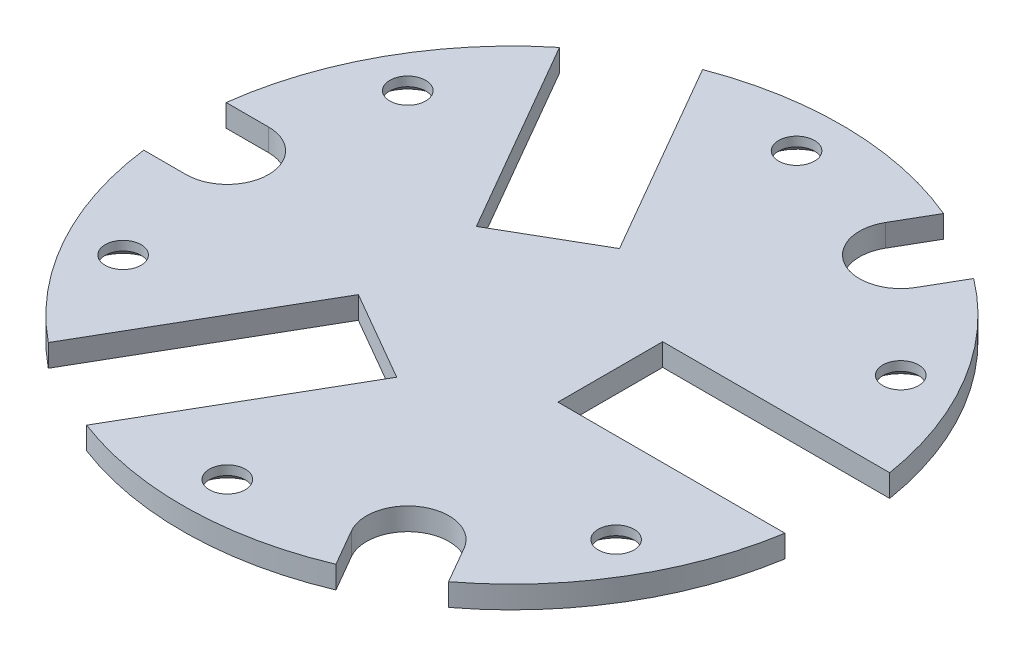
ISO-10303-21;
HEADER;
FILE_DESCRIPTION(('STEP AP214'),'2;1');
FILE_NAME('part.step','',(''),(''),'','','');
FILE_SCHEMA(('AUTOMOTIVE_DESIGN { 1 0 10303 214 1 1 1 1 }'));
ENDSEC;
DATA;
#1=APPLICATION_CONTEXT('core data for automotive mechanical design processes');
#2=APPLICATION_PROTOCOL_DEFINITION('international standard','automotive_design',2000,#1);
#3=PRODUCT_CONTEXT('',#1,'mechanical');
#4=PRODUCT('Part','Part','',(#3));
#5=PRODUCT_RELATED_PRODUCT_CATEGORY('part','',(#4));
#6=PRODUCT_DEFINITION_FORMATION('','',#4);
#7=PRODUCT_DEFINITION_CONTEXT('part definition',#1,'design');
#8=PRODUCT_DEFINITION('design','',#6,#7);
#9=PRODUCT_DEFINITION_SHAPE('','',#8);
#10=(LENGTH_UNIT() NAMED_UNIT(*) SI_UNIT(.MILLI.,.METRE.));
#11=(NAMED_UNIT(*) PLANE_ANGLE_UNIT() SI_UNIT($,.RADIAN.));
#12=(NAMED_UNIT(*) SI_UNIT($,.STERADIAN.) SOLID_ANGLE_UNIT());
#13=UNCERTAINTY_MEASURE_WITH_UNIT(LENGTH_MEASURE(1.E-05),#10,'distance_accuracy_value','');
#14=(GEOMETRIC_REPRESENTATION_CONTEXT(3) GLOBAL_UNCERTAINTY_ASSIGNED_CONTEXT((#13)) GLOBAL_UNIT_ASSIGNED_CONTEXT((#10,
#11,#12)) REPRESENTATION_CONTEXT('',''));
#15=CARTESIAN_POINT('',(0.,0.,0.));
#16=DIRECTION('',(0.,0.,1.));
#17=DIRECTION('',(1.,0.,0.));
#18=AXIS2_PLACEMENT_3D('',#15,#16,#17);
#19=CARTESIAN_POINT('',(0.,-1.1811,0.));
#20=DIRECTION('',(0.,1.,0.));
#21=DIRECTION('',(0.,0.,1.));
#22=AXIS2_PLACEMENT_3D('',#19,#20,#21);
#23=PLANE('',#22);
#24=CARTESIAN_POINT('',(0.,-1.1811,30.1625));
#25=DIRECTION('',(0.,-1.,0.));
#26=DIRECTION('',(0.,0.,-1.));
#27=AXIS2_PLACEMENT_3D('',#24,#25,#26);
#28=CIRCLE('',#27,3.5433);
#29=CARTESIAN_POINT('',(0.,-1.1811,26.6192));
#30=VERTEX_POINT('',#29);
#31=EDGE_CURVE('E767',#30,#30,#28,.T.);
#32=ORIENTED_EDGE('',*,*,#31,.F.);
#33=EDGE_LOOP('',(#32));
#34=FACE_BOUND('',#33,.T.);
#35=CARTESIAN_POINT('',(-26.1214859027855,-1.1811,15.0812500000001));
#36=DIRECTION('',(0.,-1.,0.));
#37=DIRECTION('',(0.,0.,-1.));
#38=AXIS2_PLACEMENT_3D('',#35,#36,#37);
#39=CIRCLE('',#38,3.5433);
#40=CARTESIAN_POINT('',(-26.1214859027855,-1.1811,11.5379500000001));
#41=VERTEX_POINT('',#40);
#42=EDGE_CURVE('E774',#41,#41,#39,.T.);
#43=ORIENTED_EDGE('',*,*,#42,.F.);
#44=EDGE_LOOP('',(#43));
#45=FACE_BOUND('',#44,.T.);
#46=CARTESIAN_POINT('',(-26.1214859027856,-1.1811,-15.0812499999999));
#47=DIRECTION('',(0.,-1.,0.));
#48=DIRECTION('',(0.,0.,-1.));
#49=AXIS2_PLACEMENT_3D('',#46,#47,#48);
#50=CIRCLE('',#49,3.5433);
#51=CARTESIAN_POINT('',(-26.1214859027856,-1.1811,-18.6245499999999));
#52=VERTEX_POINT('',#51);
#53=EDGE_CURVE('E783',#52,#52,#50,.T.);
#54=ORIENTED_EDGE('',*,*,#53,.F.);
#55=EDGE_LOOP('',(#54));
#56=FACE_BOUND('',#55,.T.);
#57=CARTESIAN_POINT('',(0.,-1.1811,-30.1625));
#58=DIRECTION('',(0.,-1.,0.));
#59=DIRECTION('',(0.,0.,-1.));
#60=AXIS2_PLACEMENT_3D('',#57,#58,#59);
#61=CIRCLE('',#60,3.5433);
#62=CARTESIAN_POINT('',(0.,-1.1811,-33.7058));
#63=VERTEX_POINT('',#62);
#64=EDGE_CURVE('E792',#63,#63,#61,.T.);
#65=ORIENTED_EDGE('',*,*,#64,.F.);
#66=EDGE_LOOP('',(#65));
#67=FACE_BOUND('',#66,.T.);
#68=CARTESIAN_POINT('',(26.1214859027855,-1.1811,-15.0812500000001));
#69=DIRECTION('',(0.,-1.,0.));
#70=DIRECTION('',(0.,0.,-1.));
#71=AXIS2_PLACEMENT_3D('',#68,#69,#70);
#72=CIRCLE('',#71,3.5433);
#73=CARTESIAN_POINT('',(26.1214859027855,-1.1811,-18.6245500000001));
#74=VERTEX_POINT('',#73);
#75=EDGE_CURVE('E801',#74,#74,#72,.T.);
#76=ORIENTED_EDGE('',*,*,#75,.F.);
#77=EDGE_LOOP('',(#76));
#78=FACE_BOUND('',#77,.T.);
#79=CARTESIAN_POINT('',(15.0812499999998,-1.1811,26.1214912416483));
#80=DIRECTION('',(0.,1.,0.));
#81=DIRECTION('',(0.,0.,1.));
#82=AXIS2_PLACEMENT_3D('',#79,#80,#81);
#83=CIRCLE('',#82,4.3688);
#84=CARTESIAN_POINT('',(11.2977582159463,-1.1811,28.3058912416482));
#85=VERTEX_POINT('',#84);
#86=CARTESIAN_POINT('',(18.8647417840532,-1.1811,23.9370912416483));
#87=VERTEX_POINT('',#86);
#88=EDGE_CURVE('E51',#85,#87,#83,.F.);
#89=ORIENTED_EDGE('',*,*,#88,.F.);
#90=DIRECTION('',(-0.499999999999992,0.,-0.866025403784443));
#91=VECTOR('',#90,1.);
#92=CARTESIAN_POINT('',(13.5418452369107,-1.1811,32.1927639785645));
#93=LINE('',#92,#91);
#94=CARTESIAN_POINT('',(13.5418452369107,-1.1811,32.1927639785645));
#95=VERTEX_POINT('',#94);
#96=EDGE_CURVE('E820',#95,#85,#93,.T.);
#97=ORIENTED_EDGE('',*,*,#96,.F.);
#98=CARTESIAN_POINT('',(0.,-1.1811,0.));
#99=DIRECTION('',(0.,1.,0.));
#100=DIRECTION('',(0.,0.,1.));
#101=AXIS2_PLACEMENT_3D('',#98,#99,#100);
#102=CIRCLE('',#101,34.925);
#103=CARTESIAN_POINT('',(-12.434253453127,-1.1811,32.6365587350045));
#104=VERTEX_POINT('',#103);
#105=EDGE_CURVE('E219',#104,#95,#102,.T.);
#106=ORIENTED_EDGE('',*,*,#105,.F.);
#107=DIRECTION('',(0.500000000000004,0.,-0.866025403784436));
#108=VECTOR('',#107,1.);
#109=CARTESIAN_POINT('',(-12.434253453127,-1.1811,32.6365587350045));
#110=LINE('',#109,#108);
#111=CARTESIAN_POINT('',(-0.406995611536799,-1.1811,11.8047370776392));
#112=VERTEX_POINT('',#111);
#113=EDGE_CURVE('E266',#104,#112,#110,.T.);
#114=ORIENTED_EDGE('',*,*,#113,.T.);
#115=DIRECTION('',(-0.866025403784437,0.,-0.500000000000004));
#116=VECTOR('',#115,1.);
#117=CARTESIAN_POINT('',(-0.406995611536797,-1.1811,11.8047370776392));
#118=LINE('',#117,#116);
#119=CARTESIAN_POINT('',(-10.0197043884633,-1.1811,6.25483707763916));
#120=VERTEX_POINT('',#119);
#121=EDGE_CURVE('E373',#112,#120,#118,.T.);
#122=ORIENTED_EDGE('',*,*,#121,.T.);
#123=DIRECTION('',(-0.500000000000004,0.,0.866025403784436));
#124=VECTOR('',#123,1.);
#125=CARTESIAN_POINT('',(-22.0469622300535,-1.1811,27.0866587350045));
#126=LINE('',#125,#124);
#127=CARTESIAN_POINT('',(-22.0469622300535,-1.1811,27.0866587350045));
#128=VERTEX_POINT('',#127);
#129=EDGE_CURVE('E283',#120,#128,#126,.T.);
#130=ORIENTED_EDGE('',*,*,#129,.T.);
#131=CARTESIAN_POINT('',(-34.6506740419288,-1.1811,4.36880000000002));
#132=VERTEX_POINT('',#131);
#133=EDGE_CURVE('E223',#132,#128,#102,.T.);
#134=ORIENTED_EDGE('',*,*,#133,.F.);
#135=DIRECTION('',(-1.,0.,0.));
#136=VECTOR('',#135,1.);
#137=CARTESIAN_POINT('',(-30.1625,-1.1811,4.36880000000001));
#138=LINE('',#137,#136);
#139=CARTESIAN_POINT('',(-30.1625,-1.1811,4.36880000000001));
#140=VERTEX_POINT('',#139);
#141=EDGE_CURVE('E337',#140,#132,#138,.T.);
#142=ORIENTED_EDGE('',*,*,#141,.F.);
#143=CARTESIAN_POINT('',(-30.1625,-1.1811,0.));
#144=DIRECTION('',(0.,1.,0.));
#145=DIRECTION('',(0.,0.,1.));
#146=AXIS2_PLACEMENT_3D('',#143,#144,#145);
#147=CIRCLE('',#146,4.3688);
#148=CARTESIAN_POINT('',(-30.1625,-1.1811,-4.36879999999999));
#149=VERTEX_POINT('',#148);
#150=EDGE_CURVE('E312',#149,#140,#147,.F.);
#151=ORIENTED_EDGE('',*,*,#150,.F.);
#152=DIRECTION('',(1.,0.,0.));
#153=VECTOR('',#152,1.);
#154=CARTESIAN_POINT('',(-34.6506740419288,-1.1811,-4.36879999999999));
#155=LINE('',#154,#153);
#156=CARTESIAN_POINT('',(-34.6506740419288,-1.1811,-4.36879999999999));
#157=VERTEX_POINT('',#156);
#158=EDGE_CURVE('E324',#157,#149,#155,.T.);
#159=ORIENTED_EDGE('',*,*,#158,.F.);
#160=CARTESIAN_POINT('',(-22.0469622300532,-1.1811,-27.0866587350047));
#161=VERTEX_POINT('',#160);
#162=EDGE_CURVE('E224',#161,#157,#102,.T.);
#163=ORIENTED_EDGE('',*,*,#162,.F.);
#164=DIRECTION('',(0.499999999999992,0.,0.866025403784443));
#165=VECTOR('',#164,1.);
#166=CARTESIAN_POINT('',(-22.0469622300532,-1.1811,-27.0866587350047));
#167=LINE('',#166,#165);
#168=CARTESIAN_POINT('',(-10.0197043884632,-1.1811,-6.2548370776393));
#169=VERTEX_POINT('',#168);
#170=EDGE_CURVE('E345',#161,#169,#167,.T.);
#171=ORIENTED_EDGE('',*,*,#170,.T.);
#172=DIRECTION('',(0.866025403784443,0.,-0.499999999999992));
#173=VECTOR('',#172,1.);
#174=CARTESIAN_POINT('',(-10.0197043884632,-1.1811,-6.2548370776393));
#175=LINE('',#174,#173);
#176=CARTESIAN_POINT('',(-0.406995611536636,-1.1811,-11.8047370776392));
#177=VERTEX_POINT('',#176);
#178=EDGE_CURVE('E348',#169,#177,#175,.T.);
#179=ORIENTED_EDGE('',*,*,#178,.T.);
#180=DIRECTION('',(-0.499999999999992,0.,-0.866025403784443));
#181=VECTOR('',#180,1.);
#182=CARTESIAN_POINT('',(-12.4342534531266,-1.1811,-32.6365587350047));
#183=LINE('',#182,#181);
#184=CARTESIAN_POINT('',(-12.4342534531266,-1.1811,-32.6365587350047));
#185=VERTEX_POINT('',#184);
#186=EDGE_CURVE('E352',#177,#185,#183,.T.);
#187=ORIENTED_EDGE('',*,*,#186,.T.);
#188=CARTESIAN_POINT('',(13.5418452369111,-1.1811,-32.1927639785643));
#189=VERTEX_POINT('',#188);
#190=EDGE_CURVE('E221',#189,#185,#102,.T.);
#191=ORIENTED_EDGE('',*,*,#190,.F.);
#192=DIRECTION('',(0.500000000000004,0.,-0.866025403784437));
#193=VECTOR('',#192,1.);
#194=CARTESIAN_POINT('',(11.2977582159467,-1.1811,-28.3058912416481));
#195=LINE('',#194,#193);
#196=CARTESIAN_POINT('',(11.2977582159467,-1.1811,-28.3058912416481));
#197=VERTEX_POINT('',#196);
#198=EDGE_CURVE('E309',#197,#189,#195,.T.);
#199=ORIENTED_EDGE('',*,*,#198,.F.);
#200=CARTESIAN_POINT('',(15.0812500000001,-1.1811,-26.1214912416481));
#201=DIRECTION('',(0.,1.,0.));
#202=DIRECTION('',(0.,0.,1.));
#203=AXIS2_PLACEMENT_3D('',#200,#201,#202);
#204=CIRCLE('',#203,4.3688);
#205=CARTESIAN_POINT('',(18.8647417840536,-1.1811,-23.9370912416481));
#206=VERTEX_POINT('',#205);
#207=EDGE_CURVE('E59',#206,#197,#204,.F.);
#208=ORIENTED_EDGE('',*,*,#207,.F.);
#209=DIRECTION('',(-0.500000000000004,0.,0.866025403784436));
#210=VECTOR('',#209,1.);
#211=CARTESIAN_POINT('',(21.108828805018,-1.1811,-27.8239639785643));
#212=LINE('',#211,#210);
#213=CARTESIAN_POINT('',(21.108828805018,-1.1811,-27.8239639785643));
#214=VERTEX_POINT('',#213);
#215=EDGE_CURVE('E400',#214,#206,#212,.T.);
#216=ORIENTED_EDGE('',*,*,#215,.F.);
#217=CARTESIAN_POINT('',(34.4812156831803,-1.1811,-5.54990000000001));
#218=VERTEX_POINT('',#217);
#219=EDGE_CURVE('E37',#218,#214,#102,.T.);
#220=ORIENTED_EDGE('',*,*,#219,.F.);
#221=DIRECTION('',(-1.,0.,0.));
#222=VECTOR('',#221,1.);
#223=CARTESIAN_POINT('',(34.4812156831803,-1.1811,-5.54990000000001));
#224=LINE('',#223,#222);
#225=CARTESIAN_POINT('',(10.4267,-1.1811,-5.5499));
#226=VERTEX_POINT('',#225);
#227=EDGE_CURVE('E284',#218,#226,#224,.T.);
#228=ORIENTED_EDGE('',*,*,#227,.T.);
#229=DIRECTION('',(0.,0.,1.));
#230=VECTOR('',#229,1.);
#231=CARTESIAN_POINT('',(10.4267,-1.1811,-5.5499));
#232=LINE('',#231,#230);
#233=CARTESIAN_POINT('',(10.4267,-1.1811,5.5499));
#234=VERTEX_POINT('',#233);
#235=EDGE_CURVE('E287',#226,#234,#232,.T.);
#236=ORIENTED_EDGE('',*,*,#235,.T.);
#237=DIRECTION('',(1.,0.,0.));
#238=VECTOR('',#237,1.);
#239=CARTESIAN_POINT('',(34.4812156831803,-1.1811,5.5499));
#240=LINE('',#239,#238);
#241=CARTESIAN_POINT('',(34.4812156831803,-1.1811,5.5499));
#242=VERTEX_POINT('',#241);
#243=EDGE_CURVE('E218',#234,#242,#240,.T.);
#244=ORIENTED_EDGE('',*,*,#243,.T.);
#245=CARTESIAN_POINT('',(21.1088288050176,-1.1811,27.8239639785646));
#246=VERTEX_POINT('',#245);
#247=EDGE_CURVE('E210',#246,#242,#102,.T.);
#248=ORIENTED_EDGE('',*,*,#247,.F.);
#249=DIRECTION('',(0.499999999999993,0.,0.866025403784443));
#250=VECTOR('',#249,1.);
#251=CARTESIAN_POINT('',(18.8647417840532,-1.1811,23.9370912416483));
#252=LINE('',#251,#250);
#253=EDGE_CURVE('E196',#87,#246,#252,.T.);
#254=ORIENTED_EDGE('',*,*,#253,.F.);
#255=EDGE_LOOP('',(#89,#97,#106,#114,#122,#130,#134,#142,#151,#159,#163,#171,#179,#187,#191,
#199,#208,#216,#220,#228,#236,#244,#248,#254));
#256=FACE_BOUND('',#255,.T.);
#257=CARTESIAN_POINT('',(26.1214859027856,-1.1811,15.0812499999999));
#258=DIRECTION('',(0.,-1.,0.));
#259=DIRECTION('',(0.,0.,-1.));
#260=AXIS2_PLACEMENT_3D('',#257,#258,#259);
#261=CIRCLE('',#260,3.5433);
#262=CARTESIAN_POINT('',(26.1214859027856,-1.1811,11.5379499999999));
#263=VERTEX_POINT('',#262);
#264=EDGE_CURVE('E810',#263,#263,#261,.T.);
#265=ORIENTED_EDGE('',*,*,#264,.F.);
#266=EDGE_LOOP('',(#265));
#267=FACE_BOUND('',#266,.T.);
#268=ADVANCED_FACE('F33',(#34,#45,#56,#67,#78,#256,#267),#23,.F.);
#269=CARTESIAN_POINT('',(0.,1.1811,0.));
#270=DIRECTION('',(0.,-1.,0.));
#271=DIRECTION('',(0.,0.,-1.));
#272=AXIS2_PLACEMENT_3D('',#269,#270,#271);
#273=CYLINDRICAL_SURFACE('',#272,34.925);
#274=ORIENTED_EDGE('',*,*,#105,.T.);
#275=DIRECTION('',(0.,1.,0.));
#276=VECTOR('',#275,1.);
#277=CARTESIAN_POINT('',(13.5418452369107,-1.1821,32.1927639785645));
#278=LINE('',#277,#276);
#279=CARTESIAN_POINT('',(13.5418452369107,1.1811,32.1927639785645));
#280=VERTEX_POINT('',#279);
#281=EDGE_CURVE('E205',#95,#280,#278,.T.);
#282=ORIENTED_EDGE('',*,*,#281,.T.);
#283=CARTESIAN_POINT('',(0.,1.1811,0.));
#284=DIRECTION('',(0.,1.,0.));
#285=DIRECTION('',(0.,0.,1.));
#286=AXIS2_PLACEMENT_3D('',#283,#284,#285);
#287=CIRCLE('',#286,34.925);
#288=CARTESIAN_POINT('',(-12.434253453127,1.1811,32.6365587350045));
#289=VERTEX_POINT('',#288);
#290=EDGE_CURVE('E44',#289,#280,#287,.T.);
#291=ORIENTED_EDGE('',*,*,#290,.F.);
#292=DIRECTION('',(0.,1.,0.));
#293=VECTOR('',#292,1.);
#294=CARTESIAN_POINT('',(-12.434253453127,-1.1811,32.6365587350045));
#295=LINE('',#294,#293);
#296=EDGE_CURVE('E281',#104,#289,#295,.T.);
#297=ORIENTED_EDGE('',*,*,#296,.F.);
#298=EDGE_LOOP('',(#274,#282,#291,#297));
#299=FACE_BOUND('',#298,.T.);
#300=ADVANCED_FACE('F387',(#299),#273,.T.);
#301=ORIENTED_EDGE('',*,*,#219,.T.);
#302=DIRECTION('',(0.,1.,0.));
#303=VECTOR('',#302,1.);
#304=CARTESIAN_POINT('',(21.108828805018,-1.1821,-27.8239639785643));
#305=LINE('',#304,#303);
#306=CARTESIAN_POINT('',(21.108828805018,1.1811,-27.8239639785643));
#307=VERTEX_POINT('',#306);
#308=EDGE_CURVE('E305',#214,#307,#305,.T.);
#309=ORIENTED_EDGE('',*,*,#308,.T.);
#310=CARTESIAN_POINT('',(34.4812156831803,1.1811,-5.54990000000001));
#311=VERTEX_POINT('',#310);
#312=EDGE_CURVE('E11',#311,#307,#287,.T.);
#313=ORIENTED_EDGE('',*,*,#312,.F.);
#314=DIRECTION('',(0.,1.,0.));
#315=VECTOR('',#314,1.);
#316=CARTESIAN_POINT('',(34.4812156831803,-1.1811,-5.54990000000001));
#317=LINE('',#316,#315);
#318=EDGE_CURVE('E290',#218,#311,#317,.T.);
#319=ORIENTED_EDGE('',*,*,#318,.F.);
#320=EDGE_LOOP('',(#301,#309,#313,#319));
#321=FACE_BOUND('',#320,.T.);
#322=ADVANCED_FACE('F304',(#321),#273,.T.);
#323=ORIENTED_EDGE('',*,*,#162,.T.);
#324=DIRECTION('',(0.,1.,0.));
#325=VECTOR('',#324,1.);
#326=CARTESIAN_POINT('',(-34.6506740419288,-1.1821,-4.36879999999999));
#327=LINE('',#326,#325);
#328=CARTESIAN_POINT('',(-34.6506740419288,1.1811,-4.36879999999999));
#329=VERTEX_POINT('',#328);
#330=EDGE_CURVE('E334',#157,#329,#327,.T.);
#331=ORIENTED_EDGE('',*,*,#330,.T.);
#332=CARTESIAN_POINT('',(-22.0469622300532,1.1811,-27.0866587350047));
#333=VERTEX_POINT('',#332);
#334=EDGE_CURVE('E237',#333,#329,#287,.T.);
#335=ORIENTED_EDGE('',*,*,#334,.F.);
#336=DIRECTION('',(0.,1.,0.));
#337=VECTOR('',#336,1.);
#338=CARTESIAN_POINT('',(-22.0469622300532,-1.1811,-27.0866587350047));
#339=LINE('',#338,#337);
#340=EDGE_CURVE('E355',#161,#333,#339,.T.);
#341=ORIENTED_EDGE('',*,*,#340,.F.);
#342=EDGE_LOOP('',(#323,#331,#335,#341));
#343=FACE_BOUND('',#342,.T.);
#344=ADVANCED_FACE('F431',(#343),#273,.T.);
#345=CARTESIAN_POINT('',(13.5418452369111,1.1811,-32.1927639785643));
#346=VERTEX_POINT('',#345);
#347=CARTESIAN_POINT('',(-12.4342534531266,1.1811,-32.6365587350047));
#348=VERTEX_POINT('',#347);
#349=EDGE_CURVE('E42',#346,#348,#287,.T.);
#350=ORIENTED_EDGE('',*,*,#349,.F.);
#351=DIRECTION('',(0.,1.,0.));
#352=VECTOR('',#351,1.);
#353=CARTESIAN_POINT('',(13.5418452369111,-1.1821,-32.1927639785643));
#354=LINE('',#353,#352);
#355=EDGE_CURVE('E321',#189,#346,#354,.T.);
#356=ORIENTED_EDGE('',*,*,#355,.F.);
#357=ORIENTED_EDGE('',*,*,#190,.T.);
#358=DIRECTION('',(0.,1.,0.));
#359=VECTOR('',#358,1.);
#360=CARTESIAN_POINT('',(-12.4342534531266,-1.1811,-32.6365587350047));
#361=LINE('',#360,#359);
#362=EDGE_CURVE('E362',#185,#348,#361,.T.);
#363=ORIENTED_EDGE('',*,*,#362,.T.);
#364=EDGE_LOOP('',(#350,#356,#357,#363));
#365=FACE_BOUND('',#364,.T.);
#366=ADVANCED_FACE('F411',(#365),#273,.T.);
#367=CARTESIAN_POINT('',(-34.6506740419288,1.1811,4.36880000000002));
#368=VERTEX_POINT('',#367);
#369=CARTESIAN_POINT('',(-22.0469622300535,1.1811,27.0866587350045));
#370=VERTEX_POINT('',#369);
#371=EDGE_CURVE('E236',#368,#370,#287,.T.);
#372=ORIENTED_EDGE('',*,*,#371,.F.);
#373=DIRECTION('',(0.,1.,0.));
#374=VECTOR('',#373,1.);
#375=CARTESIAN_POINT('',(-34.6506740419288,-1.1821,4.36880000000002));
#376=LINE('',#375,#374);
#377=EDGE_CURVE('E333',#132,#368,#376,.T.);
#378=ORIENTED_EDGE('',*,*,#377,.F.);
#379=ORIENTED_EDGE('',*,*,#133,.T.);
#380=DIRECTION('',(0.,1.,0.));
#381=VECTOR('',#380,1.);
#382=CARTESIAN_POINT('',(-22.0469622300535,-1.1811,27.0866587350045));
#383=LINE('',#382,#381);
#384=EDGE_CURVE('E262',#128,#370,#383,.T.);
#385=ORIENTED_EDGE('',*,*,#384,.T.);
#386=EDGE_LOOP('',(#372,#378,#379,#385));
#387=FACE_BOUND('',#386,.T.);
#388=ADVANCED_FACE('F269',(#387),#273,.T.);
#389=CARTESIAN_POINT('',(21.1088288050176,1.1811,27.8239639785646));
#390=VERTEX_POINT('',#389);
#391=CARTESIAN_POINT('',(34.4812156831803,1.1811,5.5499));
#392=VERTEX_POINT('',#391);
#393=EDGE_CURVE('E43',#390,#392,#287,.T.);
#394=ORIENTED_EDGE('',*,*,#393,.F.);
#395=DIRECTION('',(0.,1.,0.));
#396=VECTOR('',#395,1.);
#397=CARTESIAN_POINT('',(21.1088288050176,-1.1821,27.8239639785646));
#398=LINE('',#397,#396);
#399=EDGE_CURVE('E200',#246,#390,#398,.T.);
#400=ORIENTED_EDGE('',*,*,#399,.F.);
#401=ORIENTED_EDGE('',*,*,#247,.T.);
#402=DIRECTION('',(0.,1.,0.));
#403=VECTOR('',#402,1.);
#404=CARTESIAN_POINT('',(34.4812156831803,-1.1811,5.5499));
#405=LINE('',#404,#403);
#406=EDGE_CURVE('E220',#242,#392,#405,.T.);
#407=ORIENTED_EDGE('',*,*,#406,.T.);
#408=EDGE_LOOP('',(#394,#400,#401,#407));
#409=FACE_BOUND('',#408,.T.);
#410=ADVANCED_FACE('F35',(#409),#273,.T.);
#411=CARTESIAN_POINT('',(0.,1.1811,0.));
#412=DIRECTION('',(0.,1.,0.));
#413=DIRECTION('',(0.,0.,1.));
#414=AXIS2_PLACEMENT_3D('',#411,#412,#413);
#415=PLANE('',#414);
#416=CARTESIAN_POINT('',(0.,1.18109999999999,30.1625));
#417=DIRECTION('',(0.,-1.,0.));
#418=DIRECTION('',(0.,0.,-1.));
#419=AXIS2_PLACEMENT_3D('',#416,#417,#418);
#420=CIRCLE('',#419,1.89864999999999);
#421=CARTESIAN_POINT('',(0.,1.18109999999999,28.26385));
#422=VERTEX_POINT('',#421);
#423=EDGE_CURVE('E769',#422,#422,#420,.T.);
#424=ORIENTED_EDGE('',*,*,#423,.T.);
#425=EDGE_LOOP('',(#424));
#426=FACE_BOUND('',#425,.T.);
#427=CARTESIAN_POINT('',(-26.1214859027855,1.18109999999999,15.0812500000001));
#428=DIRECTION('',(0.,-1.,0.));
#429=DIRECTION('',(0.,0.,-1.));
#430=AXIS2_PLACEMENT_3D('',#427,#428,#429);
#431=CIRCLE('',#430,1.89864999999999);
#432=CARTESIAN_POINT('',(-26.1214859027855,1.18109999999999,13.1826000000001));
#433=VERTEX_POINT('',#432);
#434=EDGE_CURVE('E780',#433,#433,#431,.T.);
#435=ORIENTED_EDGE('',*,*,#434,.T.);
#436=EDGE_LOOP('',(#435));
#437=FACE_BOUND('',#436,.T.);
#438=CARTESIAN_POINT('',(-26.1214859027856,1.18109999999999,-15.0812499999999));
#439=DIRECTION('',(0.,-1.,0.));
#440=DIRECTION('',(0.,0.,-1.));
#441=AXIS2_PLACEMENT_3D('',#438,#439,#440);
#442=CIRCLE('',#441,1.89864999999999);
#443=CARTESIAN_POINT('',(-26.1214859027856,1.18109999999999,-16.9798999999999));
#444=VERTEX_POINT('',#443);
#445=EDGE_CURVE('E789',#444,#444,#442,.T.);
#446=ORIENTED_EDGE('',*,*,#445,.T.);
#447=EDGE_LOOP('',(#446));
#448=FACE_BOUND('',#447,.T.);
#449=CARTESIAN_POINT('',(0.,1.18109999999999,-30.1625));
#450=DIRECTION('',(0.,-1.,0.));
#451=DIRECTION('',(0.,0.,-1.));
#452=AXIS2_PLACEMENT_3D('',#449,#450,#451);
#453=CIRCLE('',#452,1.89864999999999);
#454=CARTESIAN_POINT('',(0.,1.18109999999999,-32.06115));
#455=VERTEX_POINT('',#454);
#456=EDGE_CURVE('E798',#455,#455,#453,.T.);
#457=ORIENTED_EDGE('',*,*,#456,.T.);
#458=EDGE_LOOP('',(#457));
#459=FACE_BOUND('',#458,.T.);
#460=CARTESIAN_POINT('',(26.1214859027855,1.18109999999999,-15.0812500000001));
#461=DIRECTION('',(0.,-1.,0.));
#462=DIRECTION('',(0.,0.,-1.));
#463=AXIS2_PLACEMENT_3D('',#460,#461,#462);
#464=CIRCLE('',#463,1.89864999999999);
#465=CARTESIAN_POINT('',(26.1214859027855,1.18109999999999,-16.9799000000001));
#466=VERTEX_POINT('',#465);
#467=EDGE_CURVE('E807',#466,#466,#464,.T.);
#468=ORIENTED_EDGE('',*,*,#467,.T.);
#469=EDGE_LOOP('',(#468));
#470=FACE_BOUND('',#469,.T.);
#471=CARTESIAN_POINT('',(26.1214859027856,1.18109999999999,15.0812499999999));
#472=DIRECTION('',(0.,-1.,0.));
#473=DIRECTION('',(0.,0.,-1.));
#474=AXIS2_PLACEMENT_3D('',#471,#472,#473);
#475=CIRCLE('',#474,1.89864999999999);
#476=CARTESIAN_POINT('',(26.1214859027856,1.18109999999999,13.1825999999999));
#477=VERTEX_POINT('',#476);
#478=EDGE_CURVE('E816',#477,#477,#475,.T.);
#479=ORIENTED_EDGE('',*,*,#478,.T.);
#480=EDGE_LOOP('',(#479));
#481=FACE_BOUND('',#480,.T.);
#482=DIRECTION('',(0.499999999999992,0.,0.866025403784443));
#483=VECTOR('',#482,1.);
#484=CARTESIAN_POINT('',(13.5418452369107,1.1811,32.1927639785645));
#485=LINE('',#484,#483);
#486=CARTESIAN_POINT('',(11.2977582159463,1.1811,28.3058912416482));
#487=VERTEX_POINT('',#486);
#488=EDGE_CURVE('E212',#487,#280,#485,.T.);
#489=ORIENTED_EDGE('',*,*,#488,.F.);
#490=CARTESIAN_POINT('',(15.0812499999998,1.1811,26.1214912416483));
#491=DIRECTION('',(0.,1.,0.));
#492=DIRECTION('',(-0.866025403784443,0.,0.499999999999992));
#493=AXIS2_PLACEMENT_3D('',#490,#491,#492);
#494=CIRCLE('',#493,4.3688);
#495=CARTESIAN_POINT('',(18.8647417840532,1.1811,23.9370912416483));
#496=VERTEX_POINT('',#495);
#497=EDGE_CURVE('E823',#496,#487,#494,.T.);
#498=ORIENTED_EDGE('',*,*,#497,.F.);
#499=DIRECTION('',(-0.499999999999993,0.,-0.866025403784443));
#500=VECTOR('',#499,1.);
#501=CARTESIAN_POINT('',(18.8647417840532,1.1811,23.9370912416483));
#502=LINE('',#501,#500);
#503=EDGE_CURVE('E822',#390,#496,#502,.T.);
#504=ORIENTED_EDGE('',*,*,#503,.F.);
#505=ORIENTED_EDGE('',*,*,#393,.T.);
#506=DIRECTION('',(1.,0.,0.));
#507=VECTOR('',#506,1.);
#508=CARTESIAN_POINT('',(34.4812156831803,1.1811,5.5499));
#509=LINE('',#508,#507);
#510=CARTESIAN_POINT('',(10.4267,1.1811,5.5499));
#511=VERTEX_POINT('',#510);
#512=EDGE_CURVE('E288',#511,#392,#509,.T.);
#513=ORIENTED_EDGE('',*,*,#512,.F.);
#514=DIRECTION('',(0.,0.,1.));
#515=VECTOR('',#514,1.);
#516=CARTESIAN_POINT('',(10.4267,1.1811,-5.5499));
#517=LINE('',#516,#515);
#518=CARTESIAN_POINT('',(10.4267,1.1811,-5.5499));
#519=VERTEX_POINT('',#518);
#520=EDGE_CURVE('E274',#519,#511,#517,.T.);
#521=ORIENTED_EDGE('',*,*,#520,.F.);
#522=DIRECTION('',(-1.,0.,0.));
#523=VECTOR('',#522,1.);
#524=CARTESIAN_POINT('',(34.4812156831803,1.1811,-5.54990000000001));
#525=LINE('',#524,#523);
#526=EDGE_CURVE('E271',#311,#519,#525,.T.);
#527=ORIENTED_EDGE('',*,*,#526,.F.);
#528=ORIENTED_EDGE('',*,*,#312,.T.);
#529=DIRECTION('',(0.500000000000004,0.,-0.866025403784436));
#530=VECTOR('',#529,1.);
#531=CARTESIAN_POINT('',(21.108828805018,1.1811,-27.8239639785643));
#532=LINE('',#531,#530);
#533=CARTESIAN_POINT('',(18.8647417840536,1.1811,-23.9370912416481));
#534=VERTEX_POINT('',#533);
#535=EDGE_CURVE('E317',#534,#307,#532,.T.);
#536=ORIENTED_EDGE('',*,*,#535,.F.);
#537=CARTESIAN_POINT('',(15.0812500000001,1.1811,-26.1214912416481));
#538=DIRECTION('',(0.,1.,0.));
#539=DIRECTION('',(0.866025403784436,0.,0.500000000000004));
#540=AXIS2_PLACEMENT_3D('',#537,#538,#539);
#541=CIRCLE('',#540,4.3688);
#542=CARTESIAN_POINT('',(11.2977582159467,1.1811,-28.3058912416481));
#543=VERTEX_POINT('',#542);
#544=EDGE_CURVE('E404',#543,#534,#541,.T.);
#545=ORIENTED_EDGE('',*,*,#544,.F.);
#546=DIRECTION('',(-0.500000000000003,0.,0.866025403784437));
#547=VECTOR('',#546,1.);
#548=CARTESIAN_POINT('',(11.2977582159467,1.1811,-28.3058912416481));
#549=LINE('',#548,#547);
#550=EDGE_CURVE('E402',#346,#543,#549,.T.);
#551=ORIENTED_EDGE('',*,*,#550,.F.);
#552=ORIENTED_EDGE('',*,*,#349,.T.);
#553=DIRECTION('',(-0.499999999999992,0.,-0.866025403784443));
#554=VECTOR('',#553,1.);
#555=CARTESIAN_POINT('',(-12.4342534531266,1.1811,-32.6365587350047));
#556=LINE('',#555,#554);
#557=CARTESIAN_POINT('',(-0.406995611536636,1.1811,-11.8047370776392));
#558=VERTEX_POINT('',#557);
#559=EDGE_CURVE('E349',#558,#348,#556,.T.);
#560=ORIENTED_EDGE('',*,*,#559,.F.);
#561=DIRECTION('',(0.866025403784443,0.,-0.499999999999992));
#562=VECTOR('',#561,1.);
#563=CARTESIAN_POINT('',(-10.0197043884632,1.1811,-6.2548370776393));
#564=LINE('',#563,#562);
#565=CARTESIAN_POINT('',(-10.0197043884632,1.1811,-6.2548370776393));
#566=VERTEX_POINT('',#565);
#567=EDGE_CURVE('E358',#566,#558,#564,.T.);
#568=ORIENTED_EDGE('',*,*,#567,.F.);
#569=DIRECTION('',(0.499999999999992,0.,0.866025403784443));
#570=VECTOR('',#569,1.);
#571=CARTESIAN_POINT('',(-22.0469622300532,1.1811,-27.0866587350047));
#572=LINE('',#571,#570);
#573=EDGE_CURVE('E344',#333,#566,#572,.T.);
#574=ORIENTED_EDGE('',*,*,#573,.F.);
#575=ORIENTED_EDGE('',*,*,#334,.T.);
#576=DIRECTION('',(-1.,0.,0.));
#577=VECTOR('',#576,1.);
#578=CARTESIAN_POINT('',(-34.6506740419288,1.1811,-4.36879999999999));
#579=LINE('',#578,#577);
#580=CARTESIAN_POINT('',(-30.1625,1.1811,-4.36879999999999));
#581=VERTEX_POINT('',#580);
#582=EDGE_CURVE('E331',#581,#329,#579,.T.);
#583=ORIENTED_EDGE('',*,*,#582,.F.);
#584=CARTESIAN_POINT('',(-30.1625,1.1811,0.));
#585=DIRECTION('',(0.,1.,0.));
#586=DIRECTION('',(0.,0.,-1.));
#587=AXIS2_PLACEMENT_3D('',#584,#585,#586);
#588=CIRCLE('',#587,4.3688);
#589=CARTESIAN_POINT('',(-30.1625,1.1811,4.36880000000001));
#590=VERTEX_POINT('',#589);
#591=EDGE_CURVE('E328',#590,#581,#588,.T.);
#592=ORIENTED_EDGE('',*,*,#591,.F.);
#593=DIRECTION('',(1.,0.,0.));
#594=VECTOR('',#593,1.);
#595=CARTESIAN_POINT('',(-30.1625,1.1811,4.36880000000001));
#596=LINE('',#595,#594);
#597=EDGE_CURVE('E254',#368,#590,#596,.T.);
#598=ORIENTED_EDGE('',*,*,#597,.F.);
#599=ORIENTED_EDGE('',*,*,#371,.T.);
#600=DIRECTION('',(-0.500000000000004,0.,0.866025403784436));
#601=VECTOR('',#600,1.);
#602=CARTESIAN_POINT('',(-22.0469622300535,1.1811,27.0866587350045));
#603=LINE('',#602,#601);
#604=CARTESIAN_POINT('',(-10.0197043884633,1.1811,6.25483707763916));
#605=VERTEX_POINT('',#604);
#606=EDGE_CURVE('E251',#605,#370,#603,.T.);
#607=ORIENTED_EDGE('',*,*,#606,.F.);
#608=DIRECTION('',(-0.866025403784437,0.,-0.500000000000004));
#609=VECTOR('',#608,1.);
#610=CARTESIAN_POINT('',(-0.406995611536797,1.1811,11.8047370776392));
#611=LINE('',#610,#609);
#612=CARTESIAN_POINT('',(-0.406995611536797,1.1811,11.8047370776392));
#613=VERTEX_POINT('',#612);
#614=EDGE_CURVE('E267',#613,#605,#611,.T.);
#615=ORIENTED_EDGE('',*,*,#614,.F.);
#616=DIRECTION('',(0.500000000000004,0.,-0.866025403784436));
#617=VECTOR('',#616,1.);
#618=CARTESIAN_POINT('',(-12.434253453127,1.1811,32.6365587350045));
#619=LINE('',#618,#617);
#620=EDGE_CURVE('E365',#289,#613,#619,.T.);
#621=ORIENTED_EDGE('',*,*,#620,.F.);
#622=ORIENTED_EDGE('',*,*,#290,.T.);
#623=EDGE_LOOP('',(#489,#498,#504,#505,#513,#521,#527,#528,#536,#545,#551,#552,#560,#568,#574,
#575,#583,#592,#598,#599,#607,#615,#621,#622));
#624=FACE_BOUND('',#623,.T.);
#625=ADVANCED_FACE('F249',(#426,#437,#448,#459,#470,#481,#624),#415,.T.);
#626=CARTESIAN_POINT('',(34.4812156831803,-1.1811,5.5499));
#627=DIRECTION('',(0.,0.,1.));
#628=DIRECTION('',(1.,0.,0.));
#629=AXIS2_PLACEMENT_3D('',#626,#627,#628);
#630=PLANE('',#629);
#631=ORIENTED_EDGE('',*,*,#512,.T.);
#632=ORIENTED_EDGE('',*,*,#406,.F.);
#633=ORIENTED_EDGE('',*,*,#243,.F.);
#634=DIRECTION('',(0.,1.,0.));
#635=VECTOR('',#634,1.);
#636=CARTESIAN_POINT('',(10.4267,-1.1811,5.5499));
#637=LINE('',#636,#635);
#638=EDGE_CURVE('E225',#234,#511,#637,.T.);
#639=ORIENTED_EDGE('',*,*,#638,.T.);
#640=EDGE_LOOP('',(#631,#632,#633,#639));
#641=FACE_BOUND('',#640,.T.);
#642=ADVANCED_FACE('F462',(#641),#630,.F.);
#643=CARTESIAN_POINT('',(10.4267,-1.1811,-5.5499));
#644=DIRECTION('',(-1.,0.,0.));
#645=DIRECTION('',(0.,0.,1.));
#646=AXIS2_PLACEMENT_3D('',#643,#644,#645);
#647=PLANE('',#646);
#648=ORIENTED_EDGE('',*,*,#520,.T.);
#649=ORIENTED_EDGE('',*,*,#638,.F.);
#650=ORIENTED_EDGE('',*,*,#235,.F.);
#651=DIRECTION('',(0.,1.,0.));
#652=VECTOR('',#651,1.);
#653=CARTESIAN_POINT('',(10.4267,-1.1811,-5.5499));
#654=LINE('',#653,#652);
#655=EDGE_CURVE('E296',#226,#519,#654,.T.);
#656=ORIENTED_EDGE('',*,*,#655,.T.);
#657=EDGE_LOOP('',(#648,#649,#650,#656));
#658=FACE_BOUND('',#657,.T.);
#659=ADVANCED_FACE('F466',(#658),#647,.F.);
#660=CARTESIAN_POINT('',(34.4812156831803,-1.1811,-5.54990000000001));
#661=DIRECTION('',(0.,0.,-1.));
#662=DIRECTION('',(-1.,0.,0.));
#663=AXIS2_PLACEMENT_3D('',#660,#661,#662);
#664=PLANE('',#663);
#665=ORIENTED_EDGE('',*,*,#526,.T.);
#666=ORIENTED_EDGE('',*,*,#655,.F.);
#667=ORIENTED_EDGE('',*,*,#227,.F.);
#668=ORIENTED_EDGE('',*,*,#318,.T.);
#669=EDGE_LOOP('',(#665,#666,#667,#668));
#670=FACE_BOUND('',#669,.T.);
#671=ADVANCED_FACE('F299',(#670),#664,.F.);
#672=CARTESIAN_POINT('',(-22.0469622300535,-1.1811,27.0866587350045));
#673=DIRECTION('',(-0.866025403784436,0.,-0.500000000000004));
#674=DIRECTION('',(-0.500000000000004,0.,0.866025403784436));
#675=AXIS2_PLACEMENT_3D('',#672,#673,#674);
#676=PLANE('',#675);
#677=ORIENTED_EDGE('',*,*,#606,.T.);
#678=ORIENTED_EDGE('',*,*,#384,.F.);
#679=ORIENTED_EDGE('',*,*,#129,.F.);
#680=DIRECTION('',(0.,1.,0.));
#681=VECTOR('',#680,1.);
#682=CARTESIAN_POINT('',(-10.0197043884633,-1.1811,6.25483707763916));
#683=LINE('',#682,#681);
#684=EDGE_CURVE('E264',#120,#605,#683,.T.);
#685=ORIENTED_EDGE('',*,*,#684,.T.);
#686=EDGE_LOOP('',(#677,#678,#679,#685));
#687=FACE_BOUND('',#686,.T.);
#688=ADVANCED_FACE('F260',(#687),#676,.F.);
#689=CARTESIAN_POINT('',(-0.406995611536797,-1.1811,11.8047370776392));
#690=DIRECTION('',(0.500000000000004,0.,-0.866025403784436));
#691=DIRECTION('',(-0.866025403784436,0.,-0.500000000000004));
#692=AXIS2_PLACEMENT_3D('',#689,#690,#691);
#693=PLANE('',#692);
#694=ORIENTED_EDGE('',*,*,#614,.T.);
#695=ORIENTED_EDGE('',*,*,#684,.F.);
#696=ORIENTED_EDGE('',*,*,#121,.F.);
#697=DIRECTION('',(0.,1.,0.));
#698=VECTOR('',#697,1.);
#699=CARTESIAN_POINT('',(-0.406995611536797,-1.1811,11.8047370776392));
#700=LINE('',#699,#698);
#701=EDGE_CURVE('E276',#112,#613,#700,.T.);
#702=ORIENTED_EDGE('',*,*,#701,.T.);
#703=EDGE_LOOP('',(#694,#695,#696,#702));
#704=FACE_BOUND('',#703,.T.);
#705=ADVANCED_FACE('F379',(#704),#693,.F.);
#706=CARTESIAN_POINT('',(-12.434253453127,-1.1811,32.6365587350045));
#707=DIRECTION('',(0.866025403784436,0.,0.500000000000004));
#708=DIRECTION('',(0.500000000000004,0.,-0.866025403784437));
#709=AXIS2_PLACEMENT_3D('',#706,#707,#708);
#710=PLANE('',#709);
#711=ORIENTED_EDGE('',*,*,#620,.T.);
#712=ORIENTED_EDGE('',*,*,#701,.F.);
#713=ORIENTED_EDGE('',*,*,#113,.F.);
#714=ORIENTED_EDGE('',*,*,#296,.T.);
#715=EDGE_LOOP('',(#711,#712,#713,#714));
#716=FACE_BOUND('',#715,.T.);
#717=ADVANCED_FACE('F442',(#716),#710,.F.);
#718=CARTESIAN_POINT('',(-12.4342534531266,-1.1811,-32.6365587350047));
#719=DIRECTION('',(0.866025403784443,0.,-0.499999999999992));
#720=DIRECTION('',(-0.499999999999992,0.,-0.866025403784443));
#721=AXIS2_PLACEMENT_3D('',#718,#719,#720);
#722=PLANE('',#721);
#723=ORIENTED_EDGE('',*,*,#559,.T.);
#724=ORIENTED_EDGE('',*,*,#362,.F.);
#725=ORIENTED_EDGE('',*,*,#186,.F.);
#726=DIRECTION('',(0.,1.,0.));
#727=VECTOR('',#726,1.);
#728=CARTESIAN_POINT('',(-0.406995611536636,-1.1811,-11.8047370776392));
#729=LINE('',#728,#727);
#730=EDGE_CURVE('E366',#177,#558,#729,.T.);
#731=ORIENTED_EDGE('',*,*,#730,.T.);
#732=EDGE_LOOP('',(#723,#724,#725,#731));
#733=FACE_BOUND('',#732,.T.);
#734=ADVANCED_FACE('F416',(#733),#722,.F.);
#735=CARTESIAN_POINT('',(-10.0197043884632,-1.1811,-6.2548370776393));
#736=DIRECTION('',(0.499999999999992,0.,0.866025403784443));
#737=DIRECTION('',(0.866025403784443,0.,-0.499999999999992));
#738=AXIS2_PLACEMENT_3D('',#735,#736,#737);
#739=PLANE('',#738);
#740=ORIENTED_EDGE('',*,*,#567,.T.);
#741=ORIENTED_EDGE('',*,*,#730,.F.);
#742=ORIENTED_EDGE('',*,*,#178,.F.);
#743=DIRECTION('',(0.,1.,0.));
#744=VECTOR('',#743,1.);
#745=CARTESIAN_POINT('',(-10.0197043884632,-1.1811,-6.2548370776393));
#746=LINE('',#745,#744);
#747=EDGE_CURVE('E368',#169,#566,#746,.T.);
#748=ORIENTED_EDGE('',*,*,#747,.T.);
#749=EDGE_LOOP('',(#740,#741,#742,#748));
#750=FACE_BOUND('',#749,.T.);
#751=ADVANCED_FACE('F421',(#750),#739,.F.);
#752=CARTESIAN_POINT('',(-22.0469622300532,-1.1811,-27.0866587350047));
#753=DIRECTION('',(-0.866025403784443,0.,0.499999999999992));
#754=DIRECTION('',(0.499999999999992,0.,0.866025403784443));
#755=AXIS2_PLACEMENT_3D('',#752,#753,#754);
#756=PLANE('',#755);
#757=ORIENTED_EDGE('',*,*,#573,.T.);
#758=ORIENTED_EDGE('',*,*,#747,.F.);
#759=ORIENTED_EDGE('',*,*,#170,.F.);
#760=ORIENTED_EDGE('',*,*,#340,.T.);
#761=EDGE_LOOP('',(#757,#758,#759,#760));
#762=FACE_BOUND('',#761,.T.);
#763=ADVANCED_FACE('F423',(#762),#756,.F.);
#764=CARTESIAN_POINT('',(-34.6506740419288,-1.1821,-4.36879999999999));
#765=DIRECTION('',(0.,0.,-1.));
#766=DIRECTION('',(-1.,0.,0.));
#767=AXIS2_PLACEMENT_3D('',#764,#765,#766);
#768=PLANE('',#767);
#769=ORIENTED_EDGE('',*,*,#158,.T.);
#770=DIRECTION('',(0.,1.,0.));
#771=VECTOR('',#770,1.);
#772=CARTESIAN_POINT('',(-30.1625,-1.1821,-4.36879999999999));
#773=LINE('',#772,#771);
#774=EDGE_CURVE('E338',#149,#581,#773,.T.);
#775=ORIENTED_EDGE('',*,*,#774,.T.);
#776=ORIENTED_EDGE('',*,*,#582,.T.);
#777=ORIENTED_EDGE('',*,*,#330,.F.);
#778=EDGE_LOOP('',(#769,#775,#776,#777));
#779=FACE_BOUND('',#778,.T.);
#780=ADVANCED_FACE('F434',(#779),#768,.F.);
#781=CARTESIAN_POINT('',(-30.1625,-1.1821,0.));
#782=DIRECTION('',(0.,1.,0.));
#783=DIRECTION('',(0.,0.,1.));
#784=AXIS2_PLACEMENT_3D('',#781,#782,#783);
#785=CYLINDRICAL_SURFACE('',#784,4.3688);
#786=ORIENTED_EDGE('',*,*,#150,.T.);
#787=DIRECTION('',(0.,1.,0.));
#788=VECTOR('',#787,1.);
#789=CARTESIAN_POINT('',(-30.1625,-1.1821,4.36880000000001));
#790=LINE('',#789,#788);
#791=EDGE_CURVE('E340',#140,#590,#790,.T.);
#792=ORIENTED_EDGE('',*,*,#791,.T.);
#793=ORIENTED_EDGE('',*,*,#591,.T.);
#794=ORIENTED_EDGE('',*,*,#774,.F.);
#795=EDGE_LOOP('',(#786,#792,#793,#794));
#796=FACE_BOUND('',#795,.T.);
#797=ADVANCED_FACE('F439',(#796),#785,.F.);
#798=CARTESIAN_POINT('',(-30.1625,-1.1821,4.36880000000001));
#799=DIRECTION('',(0.,0.,1.));
#800=DIRECTION('',(1.,0.,0.));
#801=AXIS2_PLACEMENT_3D('',#798,#799,#800);
#802=PLANE('',#801);
#803=ORIENTED_EDGE('',*,*,#141,.T.);
#804=ORIENTED_EDGE('',*,*,#377,.T.);
#805=ORIENTED_EDGE('',*,*,#597,.T.);
#806=ORIENTED_EDGE('',*,*,#791,.F.);
#807=EDGE_LOOP('',(#803,#804,#805,#806));
#808=FACE_BOUND('',#807,.T.);
#809=ADVANCED_FACE('F441',(#808),#802,.F.);
#810=CARTESIAN_POINT('',(21.108828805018,-1.1821,-27.8239639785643));
#811=DIRECTION('',(0.866025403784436,0.,0.500000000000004));
#812=DIRECTION('',(0.500000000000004,0.,-0.866025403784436));
#813=AXIS2_PLACEMENT_3D('',#810,#811,#812);
#814=PLANE('',#813);
#815=ORIENTED_EDGE('',*,*,#215,.T.);
#816=DIRECTION('',(0.,1.,0.));
#817=VECTOR('',#816,1.);
#818=CARTESIAN_POINT('',(18.8647417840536,-1.1821,-23.9370912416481));
#819=LINE('',#818,#817);
#820=EDGE_CURVE('E310',#206,#534,#819,.T.);
#821=ORIENTED_EDGE('',*,*,#820,.T.);
#822=ORIENTED_EDGE('',*,*,#535,.T.);
#823=ORIENTED_EDGE('',*,*,#308,.F.);
#824=EDGE_LOOP('',(#815,#821,#822,#823));
#825=FACE_BOUND('',#824,.T.);
#826=ADVANCED_FACE('F407',(#825),#814,.F.);
#827=CARTESIAN_POINT('',(15.0812500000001,-1.1821,-26.1214912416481));
#828=DIRECTION('',(0.,1.,0.));
#829=DIRECTION('',(0.,0.,1.));
#830=AXIS2_PLACEMENT_3D('',#827,#828,#829);
#831=CYLINDRICAL_SURFACE('',#830,4.3688);
#832=ORIENTED_EDGE('',*,*,#207,.T.);
#833=DIRECTION('',(0.,1.,0.));
#834=VECTOR('',#833,1.);
#835=CARTESIAN_POINT('',(11.2977582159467,-1.1821,-28.3058912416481));
#836=LINE('',#835,#834);
#837=EDGE_CURVE('E314',#197,#543,#836,.T.);
#838=ORIENTED_EDGE('',*,*,#837,.T.);
#839=ORIENTED_EDGE('',*,*,#544,.T.);
#840=ORIENTED_EDGE('',*,*,#820,.F.);
#841=EDGE_LOOP('',(#832,#838,#839,#840));
#842=FACE_BOUND('',#841,.T.);
#843=ADVANCED_FACE('F474',(#842),#831,.F.);
#844=CARTESIAN_POINT('',(11.2977582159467,-1.1821,-28.3058912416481));
#845=DIRECTION('',(-0.866025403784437,0.,-0.500000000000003));
#846=DIRECTION('',(-0.500000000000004,0.,0.866025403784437));
#847=AXIS2_PLACEMENT_3D('',#844,#845,#846);
#848=PLANE('',#847);
#849=ORIENTED_EDGE('',*,*,#198,.T.);
#850=ORIENTED_EDGE('',*,*,#355,.T.);
#851=ORIENTED_EDGE('',*,*,#550,.T.);
#852=ORIENTED_EDGE('',*,*,#837,.F.);
#853=EDGE_LOOP('',(#849,#850,#851,#852));
#854=FACE_BOUND('',#853,.T.);
#855=ADVANCED_FACE('F473',(#854),#848,.F.);
#856=CARTESIAN_POINT('',(13.5418452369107,-1.1821,32.1927639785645));
#857=DIRECTION('',(-0.866025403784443,0.,0.499999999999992));
#858=DIRECTION('',(0.499999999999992,0.,0.866025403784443));
#859=AXIS2_PLACEMENT_3D('',#856,#857,#858);
#860=PLANE('',#859);
#861=ORIENTED_EDGE('',*,*,#96,.T.);
#862=DIRECTION('',(0.,1.,0.));
#863=VECTOR('',#862,1.);
#864=CARTESIAN_POINT('',(11.2977582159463,-1.1821,28.3058912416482));
#865=LINE('',#864,#863);
#866=EDGE_CURVE('E392',#85,#487,#865,.T.);
#867=ORIENTED_EDGE('',*,*,#866,.T.);
#868=ORIENTED_EDGE('',*,*,#488,.T.);
#869=ORIENTED_EDGE('',*,*,#281,.F.);
#870=EDGE_LOOP('',(#861,#867,#868,#869));
#871=FACE_BOUND('',#870,.T.);
#872=ADVANCED_FACE('F481',(#871),#860,.F.);
#873=CARTESIAN_POINT('',(15.0812499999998,-1.1821,26.1214912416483));
#874=DIRECTION('',(0.,1.,0.));
#875=DIRECTION('',(0.,0.,1.));
#876=AXIS2_PLACEMENT_3D('',#873,#874,#875);
#877=CYLINDRICAL_SURFACE('',#876,4.3688);
#878=ORIENTED_EDGE('',*,*,#88,.T.);
#879=DIRECTION('',(0.,1.,0.));
#880=VECTOR('',#879,1.);
#881=CARTESIAN_POINT('',(18.8647417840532,-1.1821,23.9370912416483));
#882=LINE('',#881,#880);
#883=EDGE_CURVE('E202',#87,#496,#882,.T.);
#884=ORIENTED_EDGE('',*,*,#883,.T.);
#885=ORIENTED_EDGE('',*,*,#497,.T.);
#886=ORIENTED_EDGE('',*,*,#866,.F.);
#887=EDGE_LOOP('',(#878,#884,#885,#886));
#888=FACE_BOUND('',#887,.T.);
#889=ADVANCED_FACE('F613',(#888),#877,.F.);
#890=CARTESIAN_POINT('',(18.8647417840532,-1.1821,23.9370912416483));
#891=DIRECTION('',(0.866025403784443,0.,-0.499999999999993));
#892=DIRECTION('',(-0.499999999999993,0.,-0.866025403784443));
#893=AXIS2_PLACEMENT_3D('',#890,#891,#892);
#894=PLANE('',#893);
#895=ORIENTED_EDGE('',*,*,#253,.T.);
#896=ORIENTED_EDGE('',*,*,#399,.T.);
#897=ORIENTED_EDGE('',*,*,#503,.T.);
#898=ORIENTED_EDGE('',*,*,#883,.F.);
#899=EDGE_LOOP('',(#895,#896,#897,#898));
#900=FACE_BOUND('',#899,.T.);
#901=ADVANCED_FACE('F198',(#900),#894,.F.);
#902=CARTESIAN_POINT('',(26.1214859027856,-1.1811,15.0812499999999));
#903=DIRECTION('',(0.,-1.,0.));
#904=DIRECTION('',(0.,0.,-1.));
#905=AXIS2_PLACEMENT_3D('',#902,#903,#904);
#906=CYLINDRICAL_SURFACE('',#905,1.89864999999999);
#907=ORIENTED_EDGE('',*,*,#478,.F.);
#908=EDGE_LOOP('',(#907));
#909=FACE_BOUND('',#908,.T.);
#910=CARTESIAN_POINT('',(26.1214859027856,0.198925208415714,15.0812499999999));
#911=DIRECTION('',(0.,-1.,0.));
#912=DIRECTION('',(0.,0.,-1.));
#913=AXIS2_PLACEMENT_3D('',#910,#911,#912);
#914=CIRCLE('',#913,1.89865);
#915=CARTESIAN_POINT('',(26.1214859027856,0.198925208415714,13.1825999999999));
#916=VERTEX_POINT('',#915);
#917=EDGE_CURVE('E813',#916,#916,#914,.T.);
#918=ORIENTED_EDGE('',*,*,#917,.T.);
#919=EDGE_LOOP('',(#918));
#920=FACE_BOUND('',#919,.T.);
#921=ADVANCED_FACE('F629',(#909,#920),#906,.F.);
#922=CARTESIAN_POINT('',(26.1214859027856,-1.1811,15.0812499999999));
#923=DIRECTION('',(0.,-1.,0.));
#924=DIRECTION('',(0.,0.,-1.));
#925=AXIS2_PLACEMENT_3D('',#922,#923,#924);
#926=CONICAL_SURFACE('',#925,3.5433,0.872664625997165);
#927=ORIENTED_EDGE('',*,*,#917,.F.);
#928=EDGE_LOOP('',(#927));
#929=FACE_BOUND('',#928,.T.);
#930=ORIENTED_EDGE('',*,*,#264,.T.);
#931=EDGE_LOOP('',(#930));
#932=FACE_BOUND('',#931,.T.);
#933=ADVANCED_FACE('F648',(#929,#932),#926,.F.);
#934=CARTESIAN_POINT('',(26.1214859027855,-1.1811,-15.0812500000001));
#935=DIRECTION('',(0.,-1.,0.));
#936=DIRECTION('',(0.,0.,-1.));
#937=AXIS2_PLACEMENT_3D('',#934,#935,#936);
#938=CYLINDRICAL_SURFACE('',#937,1.89864999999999);
#939=ORIENTED_EDGE('',*,*,#467,.F.);
#940=EDGE_LOOP('',(#939));
#941=FACE_BOUND('',#940,.T.);
#942=CARTESIAN_POINT('',(26.1214859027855,0.198925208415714,-15.0812500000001));
#943=DIRECTION('',(0.,-1.,0.));
#944=DIRECTION('',(0.,0.,-1.));
#945=AXIS2_PLACEMENT_3D('',#942,#943,#944);
#946=CIRCLE('',#945,1.89865);
#947=CARTESIAN_POINT('',(26.1214859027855,0.198925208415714,-16.9799000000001));
#948=VERTEX_POINT('',#947);
#949=EDGE_CURVE('E804',#948,#948,#946,.T.);
#950=ORIENTED_EDGE('',*,*,#949,.T.);
#951=EDGE_LOOP('',(#950));
#952=FACE_BOUND('',#951,.T.);
#953=ADVANCED_FACE('F658',(#941,#952),#938,.F.);
#954=CARTESIAN_POINT('',(26.1214859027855,-1.1811,-15.0812500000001));
#955=DIRECTION('',(0.,-1.,0.));
#956=DIRECTION('',(0.,0.,-1.));
#957=AXIS2_PLACEMENT_3D('',#954,#955,#956);
#958=CONICAL_SURFACE('',#957,3.5433,0.872664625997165);
#959=ORIENTED_EDGE('',*,*,#949,.F.);
#960=EDGE_LOOP('',(#959));
#961=FACE_BOUND('',#960,.T.);
#962=ORIENTED_EDGE('',*,*,#75,.T.);
#963=EDGE_LOOP('',(#962));
#964=FACE_BOUND('',#963,.T.);
#965=ADVANCED_FACE('F668',(#961,#964),#958,.F.);
#966=CARTESIAN_POINT('',(0.,-1.1811,-30.1625));
#967=DIRECTION('',(0.,-1.,0.));
#968=DIRECTION('',(0.,0.,-1.));
#969=AXIS2_PLACEMENT_3D('',#966,#967,#968);
#970=CYLINDRICAL_SURFACE('',#969,1.89864999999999);
#971=ORIENTED_EDGE('',*,*,#456,.F.);
#972=EDGE_LOOP('',(#971));
#973=FACE_BOUND('',#972,.T.);
#974=CARTESIAN_POINT('',(0.,0.198925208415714,-30.1625));
#975=DIRECTION('',(0.,-1.,0.));
#976=DIRECTION('',(0.,0.,-1.));
#977=AXIS2_PLACEMENT_3D('',#974,#975,#976);
#978=CIRCLE('',#977,1.89865);
#979=CARTESIAN_POINT('',(0.,0.198925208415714,-32.06115));
#980=VERTEX_POINT('',#979);
#981=EDGE_CURVE('E795',#980,#980,#978,.T.);
#982=ORIENTED_EDGE('',*,*,#981,.T.);
#983=EDGE_LOOP('',(#982));
#984=FACE_BOUND('',#983,.T.);
#985=ADVANCED_FACE('F678',(#973,#984),#970,.F.);
#986=CARTESIAN_POINT('',(0.,-1.1811,-30.1625));
#987=DIRECTION('',(0.,-1.,0.));
#988=DIRECTION('',(0.,0.,-1.));
#989=AXIS2_PLACEMENT_3D('',#986,#987,#988);
#990=CONICAL_SURFACE('',#989,3.5433,0.872664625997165);
#991=ORIENTED_EDGE('',*,*,#981,.F.);
#992=EDGE_LOOP('',(#991));
#993=FACE_BOUND('',#992,.T.);
#994=ORIENTED_EDGE('',*,*,#64,.T.);
#995=EDGE_LOOP('',(#994));
#996=FACE_BOUND('',#995,.T.);
#997=ADVANCED_FACE('F688',(#993,#996),#990,.F.);
#998=CARTESIAN_POINT('',(-26.1214859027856,-1.1811,-15.0812499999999));
#999=DIRECTION('',(0.,-1.,0.));
#1000=DIRECTION('',(0.,0.,-1.));
#1001=AXIS2_PLACEMENT_3D('',#998,#999,#1000);
#1002=CYLINDRICAL_SURFACE('',#1001,1.89864999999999);
#1003=ORIENTED_EDGE('',*,*,#445,.F.);
#1004=EDGE_LOOP('',(#1003));
#1005=FACE_BOUND('',#1004,.T.);
#1006=CARTESIAN_POINT('',(-26.1214859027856,0.198925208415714,-15.0812499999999));
#1007=DIRECTION('',(0.,-1.,0.));
#1008=DIRECTION('',(0.,0.,-1.));
#1009=AXIS2_PLACEMENT_3D('',#1006,#1007,#1008);
#1010=CIRCLE('',#1009,1.89865);
#1011=CARTESIAN_POINT('',(-26.1214859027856,0.198925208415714,-16.9798999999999));
#1012=VERTEX_POINT('',#1011);
#1013=EDGE_CURVE('E786',#1012,#1012,#1010,.T.);
#1014=ORIENTED_EDGE('',*,*,#1013,.T.);
#1015=EDGE_LOOP('',(#1014));
#1016=FACE_BOUND('',#1015,.T.);
#1017=ADVANCED_FACE('F698',(#1005,#1016),#1002,.F.);
#1018=CARTESIAN_POINT('',(-26.1214859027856,-1.1811,-15.0812499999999));
#1019=DIRECTION('',(0.,-1.,0.));
#1020=DIRECTION('',(0.,0.,-1.));
#1021=AXIS2_PLACEMENT_3D('',#1018,#1019,#1020);
#1022=CONICAL_SURFACE('',#1021,3.5433,0.872664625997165);
#1023=ORIENTED_EDGE('',*,*,#1013,.F.);
#1024=EDGE_LOOP('',(#1023));
#1025=FACE_BOUND('',#1024,.T.);
#1026=ORIENTED_EDGE('',*,*,#53,.T.);
#1027=EDGE_LOOP('',(#1026));
#1028=FACE_BOUND('',#1027,.T.);
#1029=ADVANCED_FACE('F708',(#1025,#1028),#1022,.F.);
#1030=CARTESIAN_POINT('',(-26.1214859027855,-1.1811,15.0812500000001));
#1031=DIRECTION('',(0.,-1.,0.));
#1032=DIRECTION('',(0.,0.,-1.));
#1033=AXIS2_PLACEMENT_3D('',#1030,#1031,#1032);
#1034=CYLINDRICAL_SURFACE('',#1033,1.89864999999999);
#1035=ORIENTED_EDGE('',*,*,#434,.F.);
#1036=EDGE_LOOP('',(#1035));
#1037=FACE_BOUND('',#1036,.T.);
#1038=CARTESIAN_POINT('',(-26.1214859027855,0.198925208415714,15.0812500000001));
#1039=DIRECTION('',(0.,-1.,0.));
#1040=DIRECTION('',(0.,0.,-1.));
#1041=AXIS2_PLACEMENT_3D('',#1038,#1039,#1040);
#1042=CIRCLE('',#1041,1.89865);
#1043=CARTESIAN_POINT('',(-26.1214859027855,0.198925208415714,13.1826000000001));
#1044=VERTEX_POINT('',#1043);
#1045=EDGE_CURVE('E777',#1044,#1044,#1042,.T.);
#1046=ORIENTED_EDGE('',*,*,#1045,.T.);
#1047=EDGE_LOOP('',(#1046));
#1048=FACE_BOUND('',#1047,.T.);
#1049=ADVANCED_FACE('F718',(#1037,#1048),#1034,.F.);
#1050=CARTESIAN_POINT('',(-26.1214859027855,-1.1811,15.0812500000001));
#1051=DIRECTION('',(0.,-1.,0.));
#1052=DIRECTION('',(0.,0.,-1.));
#1053=AXIS2_PLACEMENT_3D('',#1050,#1051,#1052);
#1054=CONICAL_SURFACE('',#1053,3.5433,0.872664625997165);
#1055=ORIENTED_EDGE('',*,*,#1045,.F.);
#1056=EDGE_LOOP('',(#1055));
#1057=FACE_BOUND('',#1056,.T.);
#1058=ORIENTED_EDGE('',*,*,#42,.T.);
#1059=EDGE_LOOP('',(#1058));
#1060=FACE_BOUND('',#1059,.T.);
#1061=ADVANCED_FACE('F728',(#1057,#1060),#1054,.F.);
#1062=CARTESIAN_POINT('',(0.,-1.1811,30.1625));
#1063=DIRECTION('',(0.,-1.,0.));
#1064=DIRECTION('',(0.,0.,-1.));
#1065=AXIS2_PLACEMENT_3D('',#1062,#1063,#1064);
#1066=CYLINDRICAL_SURFACE('',#1065,1.89864999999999);
#1067=ORIENTED_EDGE('',*,*,#423,.F.);
#1068=EDGE_LOOP('',(#1067));
#1069=FACE_BOUND('',#1068,.T.);
#1070=CARTESIAN_POINT('',(0.,0.198925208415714,30.1625));
#1071=DIRECTION('',(0.,-1.,0.));
#1072=DIRECTION('',(0.,0.,-1.));
#1073=AXIS2_PLACEMENT_3D('',#1070,#1071,#1072);
#1074=CIRCLE('',#1073,1.89865);
#1075=CARTESIAN_POINT('',(0.,0.198925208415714,28.26385));
#1076=VERTEX_POINT('',#1075);
#1077=EDGE_CURVE('E765',#1076,#1076,#1074,.T.);
#1078=ORIENTED_EDGE('',*,*,#1077,.T.);
#1079=EDGE_LOOP('',(#1078));
#1080=FACE_BOUND('',#1079,.T.);
#1081=ADVANCED_FACE('F738',(#1069,#1080),#1066,.F.);
#1082=CARTESIAN_POINT('',(0.,-1.1811,30.1625));
#1083=DIRECTION('',(0.,-1.,0.));
#1084=DIRECTION('',(0.,0.,-1.));
#1085=AXIS2_PLACEMENT_3D('',#1082,#1083,#1084);
#1086=CONICAL_SURFACE('',#1085,3.5433,0.872664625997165);
#1087=ORIENTED_EDGE('',*,*,#1077,.F.);
#1088=EDGE_LOOP('',(#1087));
#1089=FACE_BOUND('',#1088,.T.);
#1090=ORIENTED_EDGE('',*,*,#31,.T.);
#1091=EDGE_LOOP('',(#1090));
#1092=FACE_BOUND('',#1091,.T.);
#1093=ADVANCED_FACE('F748',(#1089,#1092),#1086,.F.);
#1094=CLOSED_SHELL('',(#268,#300,#322,#344,#366,#388,#410,#625,#642,#659,#671,#688,#705,#717,
#734,#751,#763,#780,#797,#809,#826,#843,#855,#872,#889,#901,#921,#933,#953,#965,#985,#997,#1017,
#1029,#1049,#1061,#1081,#1093));
#1095=MANIFOLD_SOLID_BREP('B2',#1094);
#1096=ADVANCED_BREP_SHAPE_REPRESENTATION('',(#18,#1095),#14);
#1097=SHAPE_DEFINITION_REPRESENTATION(#9,#1096);
ENDSEC;
END-ISO-10303-21;
